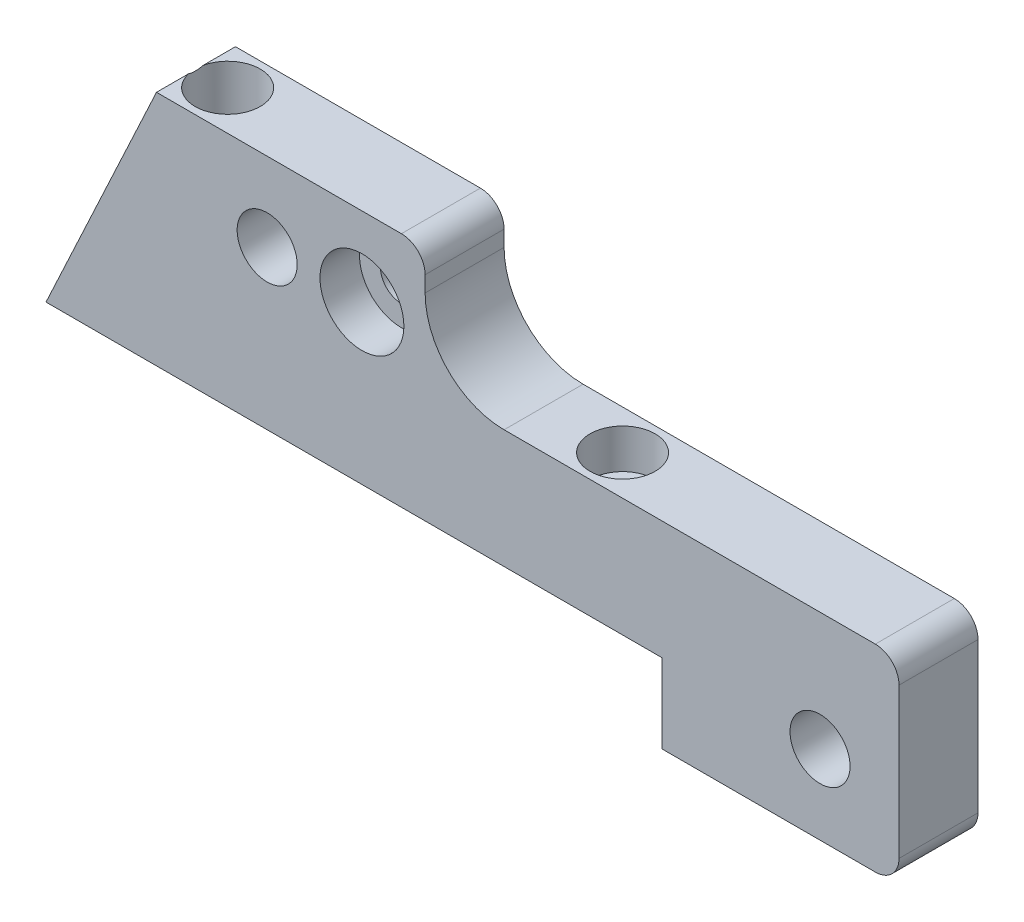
from build123d import *

# Parameters (mm, degrees)
SKETCH1_R                                         = 4.826
BOSS_EXTRUDE1_DEPTH                               = 6.35
CBORE_FOR_1_4_PAN_HEAD_MACHINE_SCREW1_D           = 6.7564
CBORE_FOR_1_4_PAN_HEAD_MACHINE_SCREW1_DEPTH       = 17.526
CBORE_FOR_1_4_PAN_HEAD_MACHINE_SCREW1_CBORE_D     = 13.49248
CBORE_FOR_1_4_PAN_HEAD_MACHINE_SCREW1_CBORE_DEPTH = 6.35
CBORE_FOR_1_4_PAN_HEAD_MACHINE_SCREW1_TIP         = 2.029827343
CBORE_FOR_1_4_PAN_HEAD_MACHINE_SCREW2_D           = 6.7564
CBORE_FOR_1_4_PAN_HEAD_MACHINE_SCREW2_CBORE_D     = 10.4648
CBORE_FOR_1_4_PAN_HEAD_MACHINE_SCREW2_CBORE_DEPTH = 19.05
CBORE_FOR_1_4_PAN_HEAD_MACHINE_SCREW3_D           = 6.7564
CBORE_FOR_1_4_PAN_HEAD_MACHINE_SCREW3_CBORE_D     = 10.4648
CBORE_FOR_1_4_PAN_HEAD_MACHINE_SCREW3_CBORE_DEPTH = 6.35


with BuildPart() as part:
    # Sketch1 → Boss-Extrude1 (new, symmetric)
    with BuildSketch(Plane.XY):
        with BuildLine():
            Line((0, 0), (-99.06, 0))
            Line((-99.06, 0), (-81.293678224, 38.1))
            Line((-81.293678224, 38.1), (-41.91, 38.1))
            ThreePointArc((-41.91, 38.1), (-39.215923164, 36.984076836), (-38.1, 34.29))
            Line((-38.1, 34.29), (-38.1, 31.75))
            ThreePointArc((-38.1, 31.75), (-34.380256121, 22.769743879), (-25.4, 19.05))
            Line((-25.4, 19.05), (34.29, 19.05))
            ThreePointArc((34.29, 19.05), (36.984076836, 17.934076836), (38.1, 15.24))
            Line((38.1, 15.24), (38.1, -8.89))
            ThreePointArc((38.1, -8.89), (36.984076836, -11.584076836), (34.29, -12.7))
            Line((34.29, -12.7), (0, -12.7))
            Line((0, -12.7), (0, 0))
        make_face()
        with Locations((-63.5, 25.4)):
            Circle(SKETCH1_R, mode=Mode.SUBTRACT)
        with Locations((25.4, 0)):
            Circle(SKETCH1_R, mode=Mode.SUBTRACT)
    extrude(amount=BOSS_EXTRUDE1_DEPTH, both=True)

    # CBORE for 1_4 Pan Head Machine Screw1
    with Locations(Plane.XY.offset(6.35)):
        with Locations((-48.26, 25.4)):
            CounterBoreHole(CBORE_FOR_1_4_PAN_HEAD_MACHINE_SCREW1_D / 2, CBORE_FOR_1_4_PAN_HEAD_MACHINE_SCREW1_CBORE_D / 2, CBORE_FOR_1_4_PAN_HEAD_MACHINE_SCREW1_CBORE_DEPTH, depth=CBORE_FOR_1_4_PAN_HEAD_MACHINE_SCREW1_DEPTH)
            with Locations((0, 0, -(CBORE_FOR_1_4_PAN_HEAD_MACHINE_SCREW1_DEPTH + CBORE_FOR_1_4_PAN_HEAD_MACHINE_SCREW1_TIP / 2))):  # 118° drill point
                Cone(0, CBORE_FOR_1_4_PAN_HEAD_MACHINE_SCREW1_D / 2, CBORE_FOR_1_4_PAN_HEAD_MACHINE_SCREW1_TIP, mode=Mode.SUBTRACT)

    # CBORE for 1_4 Pan Head Machine Screw2 (through all)
    with Locations(Plane(origin=(0, 38.1, 0), x_dir=(1, 0, 0), z_dir=(0, 1, 0))):
        with Locations((-76.2, 0)):
            CounterBoreHole(CBORE_FOR_1_4_PAN_HEAD_MACHINE_SCREW2_D / 2, CBORE_FOR_1_4_PAN_HEAD_MACHINE_SCREW2_CBORE_D / 2, CBORE_FOR_1_4_PAN_HEAD_MACHINE_SCREW2_CBORE_DEPTH)

    # CBORE for 1_4 Pan Head Machine Screw3 (through all)
    with Locations(Plane(origin=(0, 19.05, 0), x_dir=(1, 0, 0), z_dir=(0, 1, 0))):
        with Locations((-12.7, 0)):
            CounterBoreHole(CBORE_FOR_1_4_PAN_HEAD_MACHINE_SCREW3_D / 2, CBORE_FOR_1_4_PAN_HEAD_MACHINE_SCREW3_CBORE_D / 2, CBORE_FOR_1_4_PAN_HEAD_MACHINE_SCREW3_CBORE_DEPTH)


solid = part.part
